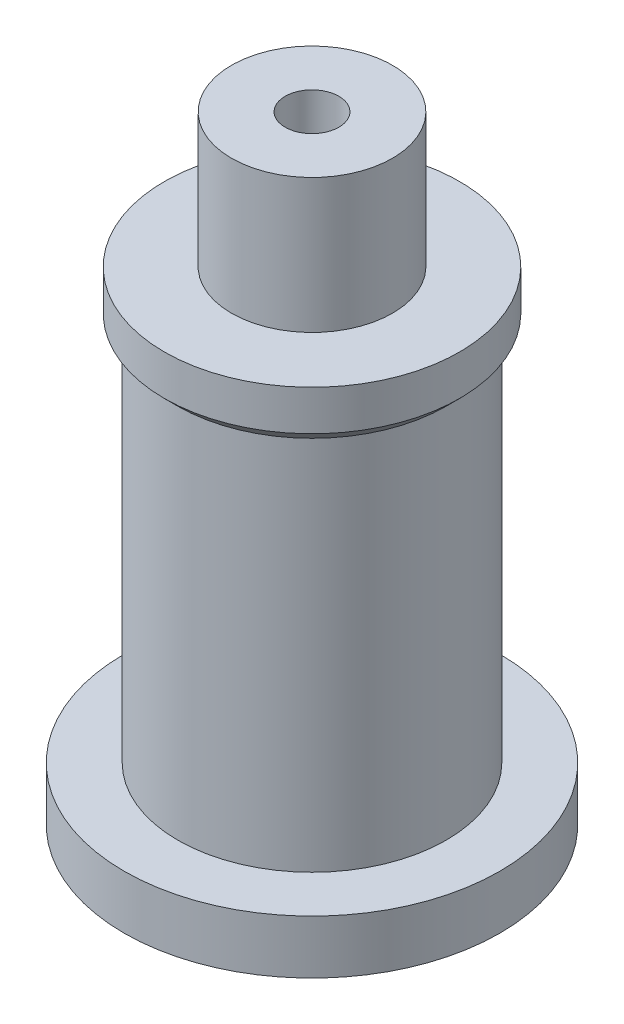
ISO-10303-21;
HEADER;
FILE_DESCRIPTION(('STEP AP214'),'2;1');
FILE_NAME('part.step','',(''),(''),'','','');
FILE_SCHEMA(('AUTOMOTIVE_DESIGN { 1 0 10303 214 1 1 1 1 }'));
ENDSEC;
DATA;
#1=APPLICATION_CONTEXT('core data for automotive mechanical design processes');
#2=APPLICATION_PROTOCOL_DEFINITION('international standard','automotive_design',2000,#1);
#3=PRODUCT_CONTEXT('',#1,'mechanical');
#4=PRODUCT('Part','Part','',(#3));
#5=PRODUCT_RELATED_PRODUCT_CATEGORY('part','',(#4));
#6=PRODUCT_DEFINITION_FORMATION('','',#4);
#7=PRODUCT_DEFINITION_CONTEXT('part definition',#1,'design');
#8=PRODUCT_DEFINITION('design','',#6,#7);
#9=PRODUCT_DEFINITION_SHAPE('','',#8);
#10=(LENGTH_UNIT() NAMED_UNIT(*) SI_UNIT(.MILLI.,.METRE.));
#11=(NAMED_UNIT(*) PLANE_ANGLE_UNIT() SI_UNIT($,.RADIAN.));
#12=(NAMED_UNIT(*) SI_UNIT($,.STERADIAN.) SOLID_ANGLE_UNIT());
#13=UNCERTAINTY_MEASURE_WITH_UNIT(LENGTH_MEASURE(1.E-05),#10,'distance_accuracy_value','');
#14=(GEOMETRIC_REPRESENTATION_CONTEXT(3) GLOBAL_UNCERTAINTY_ASSIGNED_CONTEXT((#13)) GLOBAL_UNIT_ASSIGNED_CONTEXT((#10,
#11,#12)) REPRESENTATION_CONTEXT('',''));
#15=CARTESIAN_POINT('',(0.,0.,0.));
#16=DIRECTION('',(0.,0.,1.));
#17=DIRECTION('',(1.,0.,0.));
#18=AXIS2_PLACEMENT_3D('',#15,#16,#17);
#19=CARTESIAN_POINT('',(3.,23.,0.));
#20=DIRECTION('',(0.,-1.,0.));
#21=DIRECTION('',(0.,0.,-1.));
#22=AXIS2_PLACEMENT_3D('',#19,#20,#21);
#23=PLANE('',#22);
#24=CARTESIAN_POINT('',(0.,23.,0.));
#25=DIRECTION('',(0.,1.,0.));
#26=DIRECTION('',(0.,0.,1.));
#27=AXIS2_PLACEMENT_3D('',#24,#25,#26);
#28=CIRCLE('',#27,3.);
#29=CARTESIAN_POINT('',(0.,23.,3.));
#30=VERTEX_POINT('',#29);
#31=EDGE_CURVE('E157',#30,#30,#28,.T.);
#32=ORIENTED_EDGE('',*,*,#31,.T.);
#33=EDGE_LOOP('',(#32));
#34=FACE_BOUND('',#33,.T.);
#35=CARTESIAN_POINT('',(0.,23.,0.));
#36=DIRECTION('',(0.,-1.,0.));
#37=DIRECTION('',(0.,0.,-1.));
#38=AXIS2_PLACEMENT_3D('',#35,#36,#37);
#39=CIRCLE('',#38,1.);
#40=CARTESIAN_POINT('',(0.,23.,-1.));
#41=VERTEX_POINT('',#40);
#42=EDGE_CURVE('E134',#41,#41,#39,.T.);
#43=ORIENTED_EDGE('',*,*,#42,.T.);
#44=EDGE_LOOP('',(#43));
#45=FACE_BOUND('',#44,.T.);
#46=ADVANCED_FACE('F37',(#34,#45),#23,.F.);
#47=CARTESIAN_POINT('',(0.,55.,0.));
#48=DIRECTION('',(0.,1.,0.));
#49=DIRECTION('',(0.,0.,1.));
#50=AXIS2_PLACEMENT_3D('',#47,#48,#49);
#51=CYLINDRICAL_SURFACE('',#50,3.);
#52=ORIENTED_EDGE('',*,*,#31,.F.);
#53=EDGE_LOOP('',(#52));
#54=FACE_BOUND('',#53,.T.);
#55=CARTESIAN_POINT('',(0.,18.,0.));
#56=DIRECTION('',(0.,1.,0.));
#57=DIRECTION('',(0.,0.,1.));
#58=AXIS2_PLACEMENT_3D('',#55,#56,#57);
#59=CIRCLE('',#58,3.);
#60=CARTESIAN_POINT('',(0.,18.,3.));
#61=VERTEX_POINT('',#60);
#62=EDGE_CURVE('E140',#61,#61,#59,.T.);
#63=ORIENTED_EDGE('',*,*,#62,.T.);
#64=EDGE_LOOP('',(#63));
#65=FACE_BOUND('',#64,.T.);
#66=ADVANCED_FACE('F188',(#54,#65),#51,.T.);
#67=CARTESIAN_POINT('',(7.,0.,0.));
#68=DIRECTION('',(0.,1.,0.));
#69=DIRECTION('',(0.,0.,1.));
#70=AXIS2_PLACEMENT_3D('',#67,#68,#69);
#71=PLANE('',#70);
#72=DIRECTION('',(-0.499999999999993,0.,0.866025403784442));
#73=VECTOR('',#72,1.);
#74=CARTESIAN_POINT('',(0.500000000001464,0.,4.71132486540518));
#75=LINE('',#74,#73);
#76=CARTESIAN_POINT('',(0.500000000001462,0.,4.71132486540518));
#77=VERTEX_POINT('',#76);
#78=CARTESIAN_POINT('',(1.47032094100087E-12,0.,5.57735026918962));
#79=VERTEX_POINT('',#78);
#80=EDGE_CURVE('E118',#77,#79,#75,.T.);
#81=ORIENTED_EDGE('',*,*,#80,.F.);
#82=DIRECTION('',(0.,0.,1.));
#83=VECTOR('',#82,1.);
#84=CARTESIAN_POINT('',(0.500000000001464,0.,4.71132486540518));
#85=LINE('',#84,#83);
#86=CARTESIAN_POINT('',(0.500000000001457,0.,3.71132486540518));
#87=VERTEX_POINT('',#86);
#88=EDGE_CURVE('E52',#87,#77,#85,.T.);
#89=ORIENTED_EDGE('',*,*,#88,.F.);
#90=DIRECTION('',(1.,0.,0.));
#91=VECTOR('',#90,1.);
#92=CARTESIAN_POINT('',(-0.499999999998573,0.,3.71132486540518));
#93=LINE('',#92,#91);
#94=CARTESIAN_POINT('',(-0.499999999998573,0.,3.71132486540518));
#95=VERTEX_POINT('',#94);
#96=EDGE_CURVE('E124',#95,#87,#93,.T.);
#97=ORIENTED_EDGE('',*,*,#96,.F.);
#98=DIRECTION('',(0.,0.,-1.));
#99=VECTOR('',#98,1.);
#100=CARTESIAN_POINT('',(-0.499999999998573,0.,4.71132486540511));
#101=LINE('',#100,#99);
#102=CARTESIAN_POINT('',(-0.499999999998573,0.,4.71132486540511));
#103=VERTEX_POINT('',#102);
#104=EDGE_CURVE('E122',#103,#95,#101,.T.);
#105=ORIENTED_EDGE('',*,*,#104,.F.);
#106=DIRECTION('',(-0.499999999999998,0.,-0.86602540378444));
#107=VECTOR('',#106,1.);
#108=CARTESIAN_POINT('',(1.47032094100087E-12,0.,5.57735026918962));
#109=LINE('',#108,#107);
#110=EDGE_CURVE('E94',#79,#103,#109,.T.);
#111=ORIENTED_EDGE('',*,*,#110,.F.);
#112=EDGE_LOOP('',(#81,#89,#97,#105,#111));
#113=FACE_BOUND('',#112,.T.);
#114=CARTESIAN_POINT('',(0.,0.,0.));
#115=DIRECTION('',(0.,-1.,0.));
#116=DIRECTION('',(0.,0.,-1.));
#117=AXIS2_PLACEMENT_3D('',#114,#115,#116);
#118=CIRCLE('',#117,3.1);
#119=CARTESIAN_POINT('',(0.,0.,-3.1));
#120=VERTEX_POINT('',#119);
#121=EDGE_CURVE('E127',#120,#120,#118,.T.);
#122=ORIENTED_EDGE('',*,*,#121,.F.);
#123=EDGE_LOOP('',(#122));
#124=FACE_BOUND('',#123,.T.);
#125=CARTESIAN_POINT('',(0.,0.,0.));
#126=DIRECTION('',(0.,1.,0.));
#127=DIRECTION('',(0.,0.,1.));
#128=AXIS2_PLACEMENT_3D('',#125,#126,#127);
#129=CIRCLE('',#128,7.);
#130=CARTESIAN_POINT('',(0.,0.,7.));
#131=VERTEX_POINT('',#130);
#132=EDGE_CURVE('E154',#131,#131,#129,.T.);
#133=ORIENTED_EDGE('',*,*,#132,.F.);
#134=EDGE_LOOP('',(#133));
#135=FACE_BOUND('',#134,.T.);
#136=ADVANCED_FACE('F194',(#113,#124,#135),#71,.F.);
#137=CARTESIAN_POINT('',(0.,55.,0.));
#138=DIRECTION('',(0.,1.,0.));
#139=DIRECTION('',(0.,0.,1.));
#140=AXIS2_PLACEMENT_3D('',#137,#138,#139);
#141=CYLINDRICAL_SURFACE('',#140,7.);
#142=CARTESIAN_POINT('',(0.,2.,0.));
#143=DIRECTION('',(0.,1.,0.));
#144=DIRECTION('',(0.,0.,1.));
#145=AXIS2_PLACEMENT_3D('',#142,#143,#144);
#146=CIRCLE('',#145,7.);
#147=CARTESIAN_POINT('',(0.,2.,7.));
#148=VERTEX_POINT('',#147);
#149=EDGE_CURVE('E151',#148,#148,#146,.T.);
#150=ORIENTED_EDGE('',*,*,#149,.F.);
#151=EDGE_LOOP('',(#150));
#152=FACE_BOUND('',#151,.T.);
#153=ORIENTED_EDGE('',*,*,#132,.T.);
#154=EDGE_LOOP('',(#153));
#155=FACE_BOUND('',#154,.T.);
#156=ADVANCED_FACE('F200',(#152,#155),#141,.T.);
#157=CARTESIAN_POINT('',(7.,2.,0.));
#158=DIRECTION('',(0.,-1.,0.));
#159=DIRECTION('',(0.,0.,-1.));
#160=AXIS2_PLACEMENT_3D('',#157,#158,#159);
#161=PLANE('',#160);
#162=CARTESIAN_POINT('',(0.,2.,0.));
#163=DIRECTION('',(0.,1.,0.));
#164=DIRECTION('',(0.,0.,1.));
#165=AXIS2_PLACEMENT_3D('',#162,#163,#164);
#166=CIRCLE('',#165,5.);
#167=CARTESIAN_POINT('',(0.,2.,5.));
#168=VERTEX_POINT('',#167);
#169=EDGE_CURVE('E148',#168,#168,#166,.T.);
#170=ORIENTED_EDGE('',*,*,#169,.F.);
#171=EDGE_LOOP('',(#170));
#172=FACE_BOUND('',#171,.T.);
#173=ORIENTED_EDGE('',*,*,#149,.T.);
#174=EDGE_LOOP('',(#173));
#175=FACE_BOUND('',#174,.T.);
#176=ADVANCED_FACE('F204',(#172,#175),#161,.F.);
#177=CARTESIAN_POINT('',(0.,55.,0.));
#178=DIRECTION('',(0.,1.,0.));
#179=DIRECTION('',(0.,0.,1.));
#180=AXIS2_PLACEMENT_3D('',#177,#178,#179);
#181=CYLINDRICAL_SURFACE('',#180,5.);
#182=CARTESIAN_POINT('',(0.,16.,0.));
#183=DIRECTION('',(0.,1.,0.));
#184=DIRECTION('',(0.,0.,1.));
#185=AXIS2_PLACEMENT_3D('',#182,#183,#184);
#186=CIRCLE('',#185,5.);
#187=CARTESIAN_POINT('',(0.,16.,5.));
#188=VERTEX_POINT('',#187);
#189=EDGE_CURVE('E45',#188,#188,#186,.F.);
#190=ORIENTED_EDGE('',*,*,#189,.T.);
#191=EDGE_LOOP('',(#190));
#192=FACE_BOUND('',#191,.T.);
#193=ORIENTED_EDGE('',*,*,#169,.T.);
#194=EDGE_LOOP('',(#193));
#195=FACE_BOUND('',#194,.T.);
#196=ADVANCED_FACE('F162',(#192,#195),#181,.T.);
#197=CARTESIAN_POINT('',(0.,55.,0.));
#198=DIRECTION('',(0.,1.,0.));
#199=DIRECTION('',(0.,0.,1.));
#200=AXIS2_PLACEMENT_3D('',#197,#198,#199);
#201=CYLINDRICAL_SURFACE('',#200,5.5);
#202=CARTESIAN_POINT('',(0.,16.5,0.));
#203=DIRECTION('',(0.,1.,0.));
#204=DIRECTION('',(0.,0.,1.));
#205=AXIS2_PLACEMENT_3D('',#202,#203,#204);
#206=CIRCLE('',#205,5.5);
#207=CARTESIAN_POINT('',(0.,16.5,5.5));
#208=VERTEX_POINT('',#207);
#209=EDGE_CURVE('E11',#208,#208,#206,.T.);
#210=ORIENTED_EDGE('',*,*,#209,.T.);
#211=EDGE_LOOP('',(#210));
#212=FACE_BOUND('',#211,.T.);
#213=CARTESIAN_POINT('',(0.,18.,0.));
#214=DIRECTION('',(0.,1.,0.));
#215=DIRECTION('',(0.,0.,1.));
#216=AXIS2_PLACEMENT_3D('',#213,#214,#215);
#217=CIRCLE('',#216,5.5);
#218=CARTESIAN_POINT('',(0.,18.,5.5));
#219=VERTEX_POINT('',#218);
#220=EDGE_CURVE('E145',#219,#219,#217,.T.);
#221=ORIENTED_EDGE('',*,*,#220,.F.);
#222=EDGE_LOOP('',(#221));
#223=FACE_BOUND('',#222,.T.);
#224=ADVANCED_FACE('F169',(#212,#223),#201,.T.);
#225=CARTESIAN_POINT('',(3.,18.,0.));
#226=DIRECTION('',(0.,-1.,0.));
#227=DIRECTION('',(0.,0.,-1.));
#228=AXIS2_PLACEMENT_3D('',#225,#226,#227);
#229=PLANE('',#228);
#230=ORIENTED_EDGE('',*,*,#62,.F.);
#231=EDGE_LOOP('',(#230));
#232=FACE_BOUND('',#231,.T.);
#233=ORIENTED_EDGE('',*,*,#220,.T.);
#234=EDGE_LOOP('',(#233));
#235=FACE_BOUND('',#234,.T.);
#236=ADVANCED_FACE('F172',(#232,#235),#229,.F.);
#237=CARTESIAN_POINT('',(0.,3.,0.));
#238=DIRECTION('',(0.,1.,0.));
#239=DIRECTION('',(0.,0.,1.));
#240=AXIS2_PLACEMENT_3D('',#237,#238,#239);
#241=CYLINDRICAL_SURFACE('',#240,1.);
#242=CARTESIAN_POINT('',(0.,3.,0.));
#243=DIRECTION('',(0.,-1.,0.));
#244=DIRECTION('',(0.,0.,-1.));
#245=AXIS2_PLACEMENT_3D('',#242,#243,#244);
#246=CIRCLE('',#245,1.);
#247=CARTESIAN_POINT('',(0.,3.,-1.));
#248=VERTEX_POINT('',#247);
#249=EDGE_CURVE('E137',#248,#248,#246,.T.);
#250=ORIENTED_EDGE('',*,*,#249,.T.);
#251=EDGE_LOOP('',(#250));
#252=FACE_BOUND('',#251,.T.);
#253=ORIENTED_EDGE('',*,*,#42,.F.);
#254=EDGE_LOOP('',(#253));
#255=FACE_BOUND('',#254,.T.);
#256=ADVANCED_FACE('F177',(#252,#255),#241,.F.);
#257=CARTESIAN_POINT('',(0.,3.,0.));
#258=DIRECTION('',(0.,-1.,0.));
#259=DIRECTION('',(0.,0.,-1.));
#260=AXIS2_PLACEMENT_3D('',#257,#258,#259);
#261=PLANE('',#260);
#262=ORIENTED_EDGE('',*,*,#249,.F.);
#263=EDGE_LOOP('',(#262));
#264=FACE_BOUND('',#263,.T.);
#265=ADVANCED_FACE('F183',(#264),#261,.F.);
#266=CARTESIAN_POINT('',(0.,2.6,0.));
#267=DIRECTION('',(0.,-1.,0.));
#268=DIRECTION('',(0.,0.,-1.));
#269=AXIS2_PLACEMENT_3D('',#266,#267,#268);
#270=CYLINDRICAL_SURFACE('',#269,3.1);
#271=CARTESIAN_POINT('',(0.,2.6,0.));
#272=DIRECTION('',(0.,-1.,0.));
#273=DIRECTION('',(0.,0.,-1.));
#274=AXIS2_PLACEMENT_3D('',#271,#272,#273);
#275=CIRCLE('',#274,3.1);
#276=CARTESIAN_POINT('',(0.,2.6,-3.1));
#277=VERTEX_POINT('',#276);
#278=EDGE_CURVE('E131',#277,#277,#275,.T.);
#279=ORIENTED_EDGE('',*,*,#278,.F.);
#280=EDGE_LOOP('',(#279));
#281=FACE_BOUND('',#280,.T.);
#282=ORIENTED_EDGE('',*,*,#121,.T.);
#283=EDGE_LOOP('',(#282));
#284=FACE_BOUND('',#283,.T.);
#285=ADVANCED_FACE('F276',(#281,#284),#270,.F.);
#286=CARTESIAN_POINT('',(0.,2.6,0.));
#287=DIRECTION('',(0.,-1.,0.));
#288=DIRECTION('',(0.,0.,-1.));
#289=AXIS2_PLACEMENT_3D('',#286,#287,#288);
#290=PLANE('',#289);
#291=ORIENTED_EDGE('',*,*,#278,.T.);
#292=EDGE_LOOP('',(#291));
#293=FACE_BOUND('',#292,.T.);
#294=ADVANCED_FACE('F269',(#293),#290,.T.);
#295=CARTESIAN_POINT('',(0.500000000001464,1.,4.71132486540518));
#296=DIRECTION('',(1.,0.,0.));
#297=DIRECTION('',(0.,0.,-1.));
#298=AXIS2_PLACEMENT_3D('',#295,#296,#297);
#299=PLANE('',#298);
#300=ORIENTED_EDGE('',*,*,#88,.T.);
#301=DIRECTION('',(0.,-1.,0.));
#302=VECTOR('',#301,1.);
#303=CARTESIAN_POINT('',(0.500000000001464,1.,4.71132486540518));
#304=LINE('',#303,#302);
#305=CARTESIAN_POINT('',(0.500000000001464,1.,4.71132486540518));
#306=VERTEX_POINT('',#305);
#307=EDGE_CURVE('E79',#306,#77,#304,.T.);
#308=ORIENTED_EDGE('',*,*,#307,.F.);
#309=DIRECTION('',(0.,0.,1.));
#310=VECTOR('',#309,1.);
#311=CARTESIAN_POINT('',(0.500000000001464,1.,4.71132486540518));
#312=LINE('',#311,#310);
#313=CARTESIAN_POINT('',(0.500000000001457,1.,3.71132486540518));
#314=VERTEX_POINT('',#313);
#315=EDGE_CURVE('E112',#314,#306,#312,.T.);
#316=ORIENTED_EDGE('',*,*,#315,.F.);
#317=DIRECTION('',(0.,-1.,0.));
#318=VECTOR('',#317,1.);
#319=CARTESIAN_POINT('',(0.500000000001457,1.,3.71132486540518));
#320=LINE('',#319,#318);
#321=EDGE_CURVE('E60',#314,#87,#320,.T.);
#322=ORIENTED_EDGE('',*,*,#321,.T.);
#323=EDGE_LOOP('',(#300,#308,#316,#322));
#324=FACE_BOUND('',#323,.T.);
#325=ADVANCED_FACE('F262',(#324),#299,.F.);
#326=CARTESIAN_POINT('',(-0.499999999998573,1.,3.71132486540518));
#327=DIRECTION('',(0.,0.,-1.));
#328=DIRECTION('',(-1.,0.,0.));
#329=AXIS2_PLACEMENT_3D('',#326,#327,#328);
#330=PLANE('',#329);
#331=ORIENTED_EDGE('',*,*,#96,.T.);
#332=ORIENTED_EDGE('',*,*,#321,.F.);
#333=DIRECTION('',(1.,0.,0.));
#334=VECTOR('',#333,1.);
#335=CARTESIAN_POINT('',(-0.499999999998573,1.,3.71132486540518));
#336=LINE('',#335,#334);
#337=CARTESIAN_POINT('',(-0.499999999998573,1.,3.71132486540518));
#338=VERTEX_POINT('',#337);
#339=EDGE_CURVE('E106',#338,#314,#336,.T.);
#340=ORIENTED_EDGE('',*,*,#339,.F.);
#341=DIRECTION('',(0.,-1.,0.));
#342=VECTOR('',#341,1.);
#343=CARTESIAN_POINT('',(-0.499999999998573,1.,3.71132486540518));
#344=LINE('',#343,#342);
#345=EDGE_CURVE('E98',#338,#95,#344,.T.);
#346=ORIENTED_EDGE('',*,*,#345,.T.);
#347=EDGE_LOOP('',(#331,#332,#340,#346));
#348=FACE_BOUND('',#347,.T.);
#349=ADVANCED_FACE('F255',(#348),#330,.F.);
#350=CARTESIAN_POINT('',(-0.499999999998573,1.,4.71132486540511));
#351=DIRECTION('',(-1.,0.,0.));
#352=DIRECTION('',(0.,0.,1.));
#353=AXIS2_PLACEMENT_3D('',#350,#351,#352);
#354=PLANE('',#353);
#355=ORIENTED_EDGE('',*,*,#104,.T.);
#356=ORIENTED_EDGE('',*,*,#345,.F.);
#357=DIRECTION('',(0.,0.,-1.));
#358=VECTOR('',#357,1.);
#359=CARTESIAN_POINT('',(-0.499999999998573,1.,4.71132486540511));
#360=LINE('',#359,#358);
#361=CARTESIAN_POINT('',(-0.499999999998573,1.,4.71132486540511));
#362=VERTEX_POINT('',#361);
#363=EDGE_CURVE('E102',#362,#338,#360,.T.);
#364=ORIENTED_EDGE('',*,*,#363,.F.);
#365=DIRECTION('',(0.,-1.,0.));
#366=VECTOR('',#365,1.);
#367=CARTESIAN_POINT('',(-0.499999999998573,1.,4.71132486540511));
#368=LINE('',#367,#366);
#369=EDGE_CURVE('E87',#362,#103,#368,.T.);
#370=ORIENTED_EDGE('',*,*,#369,.T.);
#371=EDGE_LOOP('',(#355,#356,#364,#370));
#372=FACE_BOUND('',#371,.T.);
#373=ADVANCED_FACE('F103',(#372),#354,.F.);
#374=CARTESIAN_POINT('',(1.47032094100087E-12,1.,5.57735026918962));
#375=DIRECTION('',(-0.86602540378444,0.,0.499999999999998));
#376=DIRECTION('',(0.499999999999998,0.,0.86602540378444));
#377=AXIS2_PLACEMENT_3D('',#374,#375,#376);
#378=PLANE('',#377);
#379=ORIENTED_EDGE('',*,*,#110,.T.);
#380=ORIENTED_EDGE('',*,*,#369,.F.);
#381=DIRECTION('',(-0.499999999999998,0.,-0.86602540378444));
#382=VECTOR('',#381,1.);
#383=CARTESIAN_POINT('',(1.47032094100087E-12,1.,5.57735026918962));
#384=LINE('',#383,#382);
#385=CARTESIAN_POINT('',(1.47032094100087E-12,1.,5.57735026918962));
#386=VERTEX_POINT('',#385);
#387=EDGE_CURVE('E91',#386,#362,#384,.T.);
#388=ORIENTED_EDGE('',*,*,#387,.F.);
#389=DIRECTION('',(0.,-1.,0.));
#390=VECTOR('',#389,1.);
#391=CARTESIAN_POINT('',(1.47032094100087E-12,1.,5.57735026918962));
#392=LINE('',#391,#390);
#393=EDGE_CURVE('E99',#386,#79,#392,.T.);
#394=ORIENTED_EDGE('',*,*,#393,.T.);
#395=EDGE_LOOP('',(#379,#380,#388,#394));
#396=FACE_BOUND('',#395,.T.);
#397=ADVANCED_FACE('F89',(#396),#378,.F.);
#398=CARTESIAN_POINT('',(0.500000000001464,1.,4.71132486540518));
#399=DIRECTION('',(0.866025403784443,0.,0.499999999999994));
#400=DIRECTION('',(0.499999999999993,0.,-0.866025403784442));
#401=AXIS2_PLACEMENT_3D('',#398,#399,#400);
#402=PLANE('',#401);
#403=ORIENTED_EDGE('',*,*,#80,.T.);
#404=ORIENTED_EDGE('',*,*,#393,.F.);
#405=DIRECTION('',(-0.499999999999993,0.,0.866025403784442));
#406=VECTOR('',#405,1.);
#407=CARTESIAN_POINT('',(0.500000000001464,1.,4.71132486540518));
#408=LINE('',#407,#406);
#409=EDGE_CURVE('E110',#306,#386,#408,.T.);
#410=ORIENTED_EDGE('',*,*,#409,.F.);
#411=ORIENTED_EDGE('',*,*,#307,.T.);
#412=EDGE_LOOP('',(#403,#404,#410,#411));
#413=FACE_BOUND('',#412,.T.);
#414=ADVANCED_FACE('F235',(#413),#402,.F.);
#415=CARTESIAN_POINT('',(0.,1.,0.));
#416=DIRECTION('',(0.,-1.,0.));
#417=DIRECTION('',(0.,0.,-1.));
#418=AXIS2_PLACEMENT_3D('',#415,#416,#417);
#419=PLANE('',#418);
#420=ORIENTED_EDGE('',*,*,#315,.T.);
#421=ORIENTED_EDGE('',*,*,#409,.T.);
#422=ORIENTED_EDGE('',*,*,#387,.T.);
#423=ORIENTED_EDGE('',*,*,#363,.T.);
#424=ORIENTED_EDGE('',*,*,#339,.T.);
#425=EDGE_LOOP('',(#420,#421,#422,#423,#424));
#426=FACE_BOUND('',#425,.T.);
#427=ADVANCED_FACE('F109',(#426),#419,.T.);
#428=CARTESIAN_POINT('',(0.,17.,0.));
#429=DIRECTION('',(0.,1.,0.));
#430=DIRECTION('',(0.,0.,1.));
#431=AXIS2_PLACEMENT_3D('',#428,#429,#430);
#432=CONICAL_SURFACE('',#431,6.00000000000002,0.785398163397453);
#433=ORIENTED_EDGE('',*,*,#189,.F.);
#434=EDGE_LOOP('',(#433));
#435=FACE_BOUND('',#434,.T.);
#436=ORIENTED_EDGE('',*,*,#209,.F.);
#437=EDGE_LOOP('',(#436));
#438=FACE_BOUND('',#437,.T.);
#439=ADVANCED_FACE('F39',(#435,#438),#432,.T.);
#440=CLOSED_SHELL('',(#46,#66,#136,#156,#176,#196,#224,#236,#256,#265,#285,#294,#325,#349,#373,
#397,#414,#427,#439));
#441=MANIFOLD_SOLID_BREP('B2',#440);
#442=ADVANCED_BREP_SHAPE_REPRESENTATION('',(#18,#441),#14);
#443=SHAPE_DEFINITION_REPRESENTATION(#9,#442);
ENDSEC;
END-ISO-10303-21;
